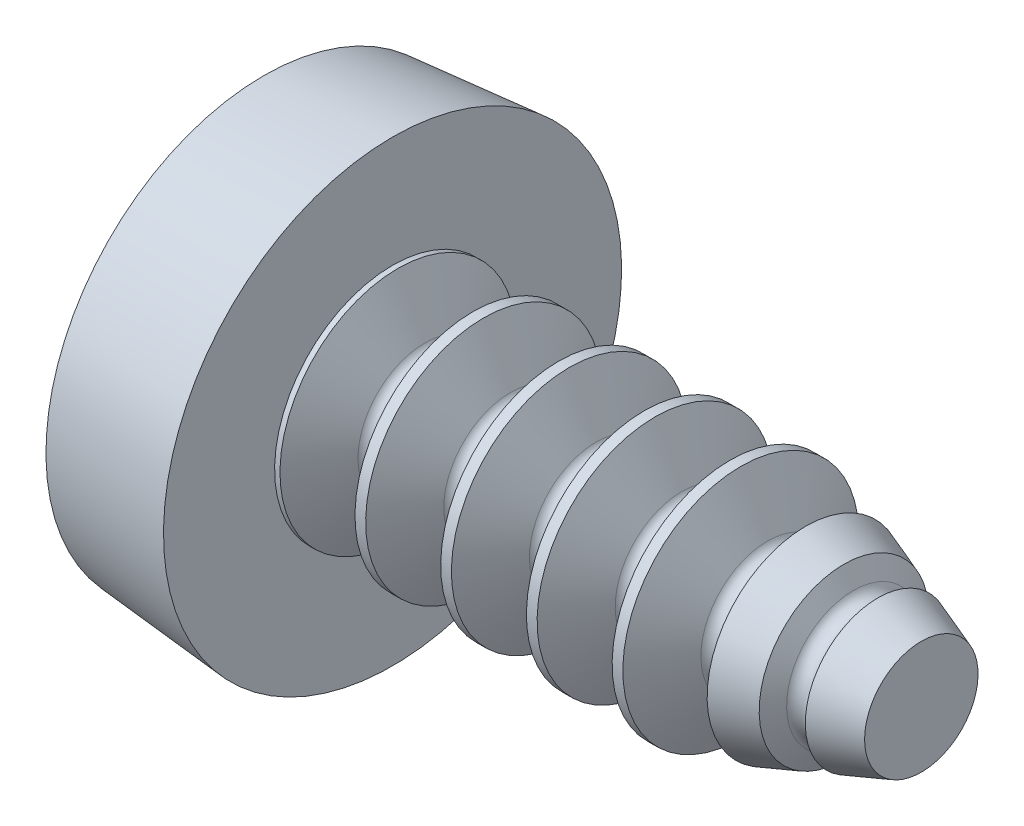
ISO-10303-21;
HEADER;
FILE_DESCRIPTION(('STEP AP214'),'2;1');
FILE_NAME('part.step','',(''),(''),'','','');
FILE_SCHEMA(('AUTOMOTIVE_DESIGN { 1 0 10303 214 1 1 1 1 }'));
ENDSEC;
DATA;
#1=APPLICATION_CONTEXT('core data for automotive mechanical design processes');
#2=APPLICATION_PROTOCOL_DEFINITION('international standard','automotive_design',2000,#1);
#3=PRODUCT_CONTEXT('',#1,'mechanical');
#4=PRODUCT('Part','Part','',(#3));
#5=PRODUCT_RELATED_PRODUCT_CATEGORY('part','',(#4));
#6=PRODUCT_DEFINITION_FORMATION('','',#4);
#7=PRODUCT_DEFINITION_CONTEXT('part definition',#1,'design');
#8=PRODUCT_DEFINITION('design','',#6,#7);
#9=PRODUCT_DEFINITION_SHAPE('','',#8);
#10=(LENGTH_UNIT() NAMED_UNIT(*) SI_UNIT(.MILLI.,.METRE.));
#11=(NAMED_UNIT(*) PLANE_ANGLE_UNIT() SI_UNIT($,.RADIAN.));
#12=(NAMED_UNIT(*) SI_UNIT($,.STERADIAN.) SOLID_ANGLE_UNIT());
#13=UNCERTAINTY_MEASURE_WITH_UNIT(LENGTH_MEASURE(1.E-05),#10,'distance_accuracy_value','');
#14=(GEOMETRIC_REPRESENTATION_CONTEXT(3) GLOBAL_UNCERTAINTY_ASSIGNED_CONTEXT((#13)) GLOBAL_UNIT_ASSIGNED_CONTEXT((#10,
#11,#12)) REPRESENTATION_CONTEXT('',''));
#15=CARTESIAN_POINT('',(0.,0.,0.));
#16=DIRECTION('',(0.,0.,1.));
#17=DIRECTION('',(1.,0.,0.));
#18=AXIS2_PLACEMENT_3D('',#15,#16,#17);
#19=DIRECTION('',(0.940483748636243,-0.339838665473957,0.));
#20=VECTOR('',#19,1.);
#21=CARTESIAN_POINT('',(-499000.,180313.218907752,0.));
#22=LINE('',#21,#20);
#23=CARTESIAN_POINT('',(6.35000000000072,0.,0.));
#24=DIRECTION('',(-1.,0.,0.));
#25=AXIS1_PLACEMENT('',#23,#24);
#26=SURFACE_OF_REVOLUTION('',#22,#25);
#27=CARTESIAN_POINT('',(4.89627290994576,0.,0.));
#28=DIRECTION('',(-1.,0.,0.));
#29=DIRECTION('',(0.,0.,1.));
#30=AXIS2_PLACEMENT_3D('',#27,#28,#29);
#31=CIRCLE('',#30,0.525296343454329);
#32=CARTESIAN_POINT('',(4.89627290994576,0.,0.525296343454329));
#33=VERTEX_POINT('',#32);
#34=EDGE_CURVE('E36',#33,#33,#31,.F.);
#35=ORIENTED_EDGE('',*,*,#34,.F.);
#36=EDGE_LOOP('',(#35));
#37=FACE_BOUND('',#36,.T.);
#38=CARTESIAN_POINT('',(4.49290623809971,0.,0.));
#39=DIRECTION('',(1.,0.,0.));
#40=DIRECTION('',(0.,1.,0.));
#41=AXIS2_PLACEMENT_3D('',#38,#39,#40);
#42=CIRCLE('',#41,0.671050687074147);
#43=CARTESIAN_POINT('',(4.49290623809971,0.671050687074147,0.));
#44=VERTEX_POINT('',#43);
#45=EDGE_CURVE('E11',#44,#44,#42,.T.);
#46=ORIENTED_EDGE('',*,*,#45,.T.);
#47=EDGE_LOOP('',(#46));
#48=FACE_BOUND('',#47,.T.);
#49=ADVANCED_FACE('F32',(#37,#48),#26,.F.);
#50=CARTESIAN_POINT('',(1.66370000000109,0.,0.));
#51=DIRECTION('',(1.,0.,0.));
#52=DIRECTION('',(0.,0.,-1.));
#53=AXIS2_PLACEMENT_3D('',#50,#51,#52);
#54=CYLINDRICAL_SURFACE('',#53,1.09220000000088);
#55=CARTESIAN_POINT('',(3.125390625,0.,0.));
#56=DIRECTION('',(1.,0.,0.));
#57=DIRECTION('',(0.,1.,0.));
#58=AXIS2_PLACEMENT_3D('',#55,#56,#57);
#59=CIRCLE('',#58,1.09220000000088);
#60=CARTESIAN_POINT('',(3.125390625,1.09220000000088,0.));
#61=VERTEX_POINT('',#60);
#62=EDGE_CURVE('E532',#61,#61,#59,.T.);
#63=ORIENTED_EDGE('',*,*,#62,.T.);
#64=EDGE_LOOP('',(#63));
#65=FACE_BOUND('',#64,.T.);
#66=CARTESIAN_POINT('',(3.224609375,0.,0.));
#67=DIRECTION('',(-1.,0.,0.));
#68=DIRECTION('',(0.,1.,0.));
#69=AXIS2_PLACEMENT_3D('',#66,#67,#68);
#70=CIRCLE('',#69,1.09220000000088);
#71=CARTESIAN_POINT('',(3.224609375,1.09220000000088,0.));
#72=VERTEX_POINT('',#71);
#73=EDGE_CURVE('E536',#72,#72,#70,.T.);
#74=ORIENTED_EDGE('',*,*,#73,.T.);
#75=EDGE_LOOP('',(#74));
#76=FACE_BOUND('',#75,.T.);
#77=ADVANCED_FACE('F229',(#65,#76),#54,.T.);
#78=CARTESIAN_POINT('',(0.,1.60655000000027,0.));
#79=DIRECTION('',(1.,0.,0.));
#80=DIRECTION('',(0.,0.,-1.));
#81=AXIS2_PLACEMENT_3D('',#78,#79,#80);
#82=PLANE('',#81);
#83=CARTESIAN_POINT('',(0.,0.,0.));
#84=DIRECTION('',(1.,0.,0.));
#85=DIRECTION('',(0.,1.,0.));
#86=AXIS2_PLACEMENT_3D('',#83,#84,#85);
#87=CIRCLE('',#86,2.12090000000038);
#88=CARTESIAN_POINT('',(0.,2.12090000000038,0.));
#89=VERTEX_POINT('',#88);
#90=EDGE_CURVE('E42',#89,#89,#87,.T.);
#91=ORIENTED_EDGE('',*,*,#90,.T.);
#92=EDGE_LOOP('',(#91));
#93=FACE_BOUND('',#92,.T.);
#94=CARTESIAN_POINT('',(0.,0.,0.));
#95=DIRECTION('',(1.,0.,0.));
#96=DIRECTION('',(0.,1.,0.));
#97=AXIS2_PLACEMENT_3D('',#94,#95,#96);
#98=CIRCLE('',#97,1.09220000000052);
#99=CARTESIAN_POINT('',(0.,1.09220000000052,0.));
#100=VERTEX_POINT('',#99);
#101=EDGE_CURVE('E595',#100,#100,#98,.T.);
#102=ORIENTED_EDGE('',*,*,#101,.F.);
#103=EDGE_LOOP('',(#102));
#104=FACE_BOUND('',#103,.T.);
#105=ADVANCED_FACE('F234',(#93,#104),#82,.T.);
#106=DIRECTION('',(-0.996194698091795,-0.0871557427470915,0.));
#107=VECTOR('',#106,1.);
#108=CARTESIAN_POINT('',(499000.,43658.9639991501,0.));
#109=LINE('',#108,#107);
#110=CARTESIAN_POINT('',(-24.241997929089,0.,0.));
#111=DIRECTION('',(1.,0.,0.));
#112=AXIS1_PLACEMENT('',#110,#111);
#113=SURFACE_OF_REVOLUTION('',#109,#112);
#114=CARTESIAN_POINT('',(-1.19285891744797,0.,0.));
#115=DIRECTION('',(1.,0.,0.));
#116=DIRECTION('',(0.,1.,0.));
#117=AXIS2_PLACEMENT_3D('',#114,#115,#116);
#118=CIRCLE('',#117,2.01653836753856);
#119=CARTESIAN_POINT('',(-1.19285891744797,2.01653836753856,0.));
#120=VERTEX_POINT('',#119);
#121=EDGE_CURVE('E544',#120,#120,#118,.T.);
#122=ORIENTED_EDGE('',*,*,#121,.T.);
#123=EDGE_LOOP('',(#122));
#124=FACE_BOUND('',#123,.T.);
#125=ORIENTED_EDGE('',*,*,#90,.F.);
#126=EDGE_LOOP('',(#125));
#127=FACE_BOUND('',#126,.T.);
#128=ADVANCED_FACE('F238',(#124,#127),#113,.F.);
#129=CARTESIAN_POINT('',(-1.41428414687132,1.32079999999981,-0.3556));
#130=DIRECTION('',(0.,0.,1.));
#131=DIRECTION('',(1.,0.,0.));
#132=AXIS2_PLACEMENT_3D('',#129,#130,#131);
#133=PLANE('',#132);
#134=DIRECTION('',(0.,-1.,0.));
#135=VECTOR('',#134,1.);
#136=CARTESIAN_POINT('',(-0.355600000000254,0.660399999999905,-0.3556));
#137=LINE('',#136,#135);
#138=CARTESIAN_POINT('',(-0.355600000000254,0.355599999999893,-0.355599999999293));
#139=VERTEX_POINT('',#138);
#140=CARTESIAN_POINT('',(-0.355600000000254,-0.355599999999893,-0.3556));
#141=VERTEX_POINT('',#140);
#142=EDGE_CURVE('E473',#139,#141,#137,.T.);
#143=ORIENTED_EDGE('',*,*,#142,.T.);
#144=DIRECTION('',(0.738980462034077,0.673726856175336,0.));
#145=VECTOR('',#144,1.);
#146=CARTESIAN_POINT('',(-1.41428414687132,-1.32079999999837,-0.3556));
#147=LINE('',#146,#145);
#148=CARTESIAN_POINT('',(0.0344415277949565,0.,-0.3556));
#149=VERTEX_POINT('',#148);
#150=EDGE_CURVE('E470',#141,#149,#147,.T.);
#151=ORIENTED_EDGE('',*,*,#150,.T.);
#152=DIRECTION('',(-0.738980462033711,0.673726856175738,0.));
#153=VECTOR('',#152,1.);
#154=CARTESIAN_POINT('',(0.0344415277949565,0.,-0.3556));
#155=LINE('',#154,#153);
#156=EDGE_CURVE('E474',#149,#139,#155,.T.);
#157=ORIENTED_EDGE('',*,*,#156,.T.);
#158=EDGE_LOOP('',(#143,#151,#157));
#159=FACE_BOUND('',#158,.T.);
#160=ADVANCED_FACE('F242',(#159),#133,.T.);
#161=CARTESIAN_POINT('',(-1.41428414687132,1.32079999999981,-0.3556));
#162=DIRECTION('',(0.,0.,1.));
#163=DIRECTION('',(1.,0.,0.));
#164=AXIS2_PLACEMENT_3D('',#161,#162,#163);
#165=PLANE('',#164);
#166=DIRECTION('',(-0.96964659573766,-0.244510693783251,0.));
#167=VECTOR('',#166,1.);
#168=CARTESIAN_POINT('',(-62.1137288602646,-15.8271772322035,-0.355599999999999));
#169=LINE('',#168,#167);
#170=CARTESIAN_POINT('',(-0.758693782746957,-0.355599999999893,-0.355600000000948));
#171=VERTEX_POINT('',#170);
#172=CARTESIAN_POINT('',(-1.53561556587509,-0.55151228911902,-0.3556));
#173=VERTEX_POINT('',#172);
#174=EDGE_CURVE('E480',#171,#173,#169,.T.);
#175=ORIENTED_EDGE('',*,*,#174,.T.);
#176=CARTESIAN_POINT('',(3.93954000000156,3.60955709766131E-13,-0.3556));
#177=DIRECTION('',(0.,0.,-1.));
#178=DIRECTION('',(0.,-1.,0.));
#179=AXIS2_PLACEMENT_3D('',#176,#177,#178);
#180=CIRCLE('',#179,5.50286237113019);
#181=CARTESIAN_POINT('',(-1.40463012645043,-1.31199845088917,-0.3556));
#182=VERTEX_POINT('',#181);
#183=EDGE_CURVE('E185',#182,#173,#180,.T.);
#184=ORIENTED_EDGE('',*,*,#183,.F.);
#185=DIRECTION('',(0.738980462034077,0.673726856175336,0.));
#186=VECTOR('',#185,1.);
#187=CARTESIAN_POINT('',(-1.41428414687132,-1.32079999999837,-0.3556));
#188=LINE('',#187,#186);
#189=EDGE_CURVE('E180',#182,#141,#188,.T.);
#190=ORIENTED_EDGE('',*,*,#189,.T.);
#191=DIRECTION('',(-1.,0.,0.));
#192=VECTOR('',#191,1.);
#193=CARTESIAN_POINT('',(-64.9945420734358,-0.355599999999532,-0.3556));
#194=LINE('',#193,#192);
#195=EDGE_CURVE('E220',#141,#171,#194,.T.);
#196=ORIENTED_EDGE('',*,*,#195,.T.);
#197=EDGE_LOOP('',(#175,#184,#190,#196));
#198=FACE_BOUND('',#197,.T.);
#199=ADVANCED_FACE('F246',(#198),#165,.T.);
#200=CARTESIAN_POINT('',(3.93954000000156,3.60955709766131E-13,0.));
#201=DIRECTION('',(0.706467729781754,0.570320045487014,0.419092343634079));
#202=DIRECTION('',(-0.570351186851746,0.809382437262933,-0.139998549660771));
#203=AXIS2_PLACEMENT_3D('',#200,#201,#202);
#204=SPHERICAL_SURFACE('',#203,5.51434000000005);
#205=ORIENTED_EDGE('',*,*,#121,.F.);
#206=EDGE_LOOP('',(#205));
#207=FACE_BOUND('',#206,.T.);
#208=CARTESIAN_POINT('',(3.76597984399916,-0.68828079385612,-0.491540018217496));
#209=DIRECTION('',(0.201018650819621,0.797171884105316,0.569305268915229));
#210=DIRECTION('',(0.,0.581168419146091,-0.813783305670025));
#211=AXIS2_PLACEMENT_3D('',#208,#209,#210);
#212=CIRCLE('',#211,5.44632724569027);
#213=CARTESIAN_POINT('',(-1.41428414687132,0.933946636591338,-0.933946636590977));
#214=VERTEX_POINT('',#213);
#215=CARTESIAN_POINT('',(-1.53561556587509,0.551512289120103,-0.3556));
#216=VERTEX_POINT('',#215);
#217=EDGE_CURVE('E209',#214,#216,#212,.T.);
#218=ORIENTED_EDGE('',*,*,#217,.T.);
#219=CARTESIAN_POINT('',(3.93954000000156,3.60955709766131E-13,-0.3556));
#220=DIRECTION('',(0.,0.,-1.));
#221=DIRECTION('',(0.,-1.,0.));
#222=AXIS2_PLACEMENT_3D('',#219,#220,#221);
#223=CIRCLE('',#222,5.50286237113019);
#224=CARTESIAN_POINT('',(-1.40463012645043,1.31199845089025,-0.3556));
#225=VERTEX_POINT('',#224);
#226=EDGE_CURVE('E207',#216,#225,#223,.T.);
#227=ORIENTED_EDGE('',*,*,#226,.T.);
#228=CARTESIAN_POINT('',(2.16698504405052,-1.94423521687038,0.));
#229=DIRECTION('',(0.673726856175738,0.738980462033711,0.));
#230=DIRECTION('',(0.,0.,-1.));
#231=AXIS2_PLACEMENT_3D('',#228,#229,#230);
#232=CIRCLE('',#231,4.84622987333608);
#233=CARTESIAN_POINT('',(-1.40463012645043,1.31199845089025,0.3556));
#234=VERTEX_POINT('',#233);
#235=EDGE_CURVE('E210',#225,#234,#232,.T.);
#236=ORIENTED_EDGE('',*,*,#235,.T.);
#237=CARTESIAN_POINT('',(3.93954000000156,3.60955709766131E-13,0.3556));
#238=DIRECTION('',(0.,0.,1.));
#239=DIRECTION('',(0.,1.,0.));
#240=AXIS2_PLACEMENT_3D('',#237,#238,#239);
#241=CIRCLE('',#240,5.50286237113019);
#242=CARTESIAN_POINT('',(-1.53561556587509,0.55151228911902,0.3556));
#243=VERTEX_POINT('',#242);
#244=EDGE_CURVE('E218',#234,#243,#241,.T.);
#245=ORIENTED_EDGE('',*,*,#244,.T.);
#246=CARTESIAN_POINT('',(3.76597984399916,-0.688280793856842,0.491540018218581));
#247=DIRECTION('',(0.201018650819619,0.797171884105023,-0.569305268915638));
#248=DIRECTION('',(0.,-0.581168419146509,-0.813783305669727));
#249=AXIS2_PLACEMENT_3D('',#246,#247,#248);
#250=CIRCLE('',#249,5.44632724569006);
#251=CARTESIAN_POINT('',(-1.41428414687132,0.933946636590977,0.933946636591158));
#252=VERTEX_POINT('',#251);
#253=EDGE_CURVE('E214',#243,#252,#250,.T.);
#254=ORIENTED_EDGE('',*,*,#253,.T.);
#255=CARTESIAN_POINT('',(3.76597984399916,0.491540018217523,-0.688280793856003));
#256=DIRECTION('',(0.201018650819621,-0.569305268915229,0.797171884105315));
#257=DIRECTION('',(0.,0.813783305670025,0.581168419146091));
#258=AXIS2_PLACEMENT_3D('',#255,#256,#257);
#259=CIRCLE('',#258,5.44632724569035);
#260=CARTESIAN_POINT('',(-1.53561556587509,0.355599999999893,0.55151228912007));
#261=VERTEX_POINT('',#260);
#262=EDGE_CURVE('E211',#252,#261,#259,.T.);
#263=ORIENTED_EDGE('',*,*,#262,.T.);
#264=CARTESIAN_POINT('',(3.93954000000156,0.355599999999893,0.));
#265=DIRECTION('',(0.,1.,0.));
#266=DIRECTION('',(0.,0.,-1.));
#267=AXIS2_PLACEMENT_3D('',#264,#265,#266);
#268=CIRCLE('',#267,5.50286237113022);
#269=CARTESIAN_POINT('',(-1.40463012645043,0.355599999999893,1.3119984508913));
#270=VERTEX_POINT('',#269);
#271=EDGE_CURVE('E215',#261,#270,#268,.T.);
#272=ORIENTED_EDGE('',*,*,#271,.T.);
#273=CARTESIAN_POINT('',(2.16698504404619,3.60955709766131E-13,-1.94423521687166));
#274=DIRECTION('',(0.673726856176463,0.,0.73898046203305));
#275=DIRECTION('',(0.,1.,0.));
#276=AXIS2_PLACEMENT_3D('',#273,#274,#275);
#277=CIRCLE('',#276,4.84622987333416);
#278=CARTESIAN_POINT('',(-1.40463012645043,-0.355599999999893,1.31199845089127));
#279=VERTEX_POINT('',#278);
#280=EDGE_CURVE('E492',#270,#279,#277,.T.);
#281=ORIENTED_EDGE('',*,*,#280,.T.);
#282=CARTESIAN_POINT('',(3.93954000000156,-0.355599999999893,0.));
#283=DIRECTION('',(0.,-1.,0.));
#284=DIRECTION('',(0.,0.,1.));
#285=AXIS2_PLACEMENT_3D('',#282,#283,#284);
#286=CIRCLE('',#285,5.50286237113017);
#287=CARTESIAN_POINT('',(-1.53561556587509,-0.355599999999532,0.551512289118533));
#288=VERTEX_POINT('',#287);
#289=EDGE_CURVE('E479',#279,#288,#286,.T.);
#290=ORIENTED_EDGE('',*,*,#289,.T.);
#291=CARTESIAN_POINT('',(3.76597984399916,-0.491540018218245,-0.68828079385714));
#292=DIRECTION('',(0.201018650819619,0.569305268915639,0.797171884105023));
#293=DIRECTION('',(0.,0.813783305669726,-0.581168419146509));
#294=AXIS2_PLACEMENT_3D('',#291,#292,#293);
#295=CIRCLE('',#294,5.44632724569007);
#296=CARTESIAN_POINT('',(-1.41428414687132,-0.933946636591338,0.933946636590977));
#297=VERTEX_POINT('',#296);
#298=EDGE_CURVE('E477',#288,#297,#295,.T.);
#299=ORIENTED_EDGE('',*,*,#298,.T.);
#300=CARTESIAN_POINT('',(3.76597984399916,0.68828079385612,0.491540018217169));
#301=DIRECTION('',(0.201018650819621,-0.797171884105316,-0.569305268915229));
#302=DIRECTION('',(0.,-0.581168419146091,0.813783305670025));
#303=AXIS2_PLACEMENT_3D('',#300,#301,#302);
#304=CIRCLE('',#303,5.44632724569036);
#305=CARTESIAN_POINT('',(-1.53561556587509,-0.551512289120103,0.3556));
#306=VERTEX_POINT('',#305);
#307=EDGE_CURVE('E193',#297,#306,#304,.T.);
#308=ORIENTED_EDGE('',*,*,#307,.T.);
#309=CARTESIAN_POINT('',(3.93954000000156,3.60955709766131E-13,0.3556));
#310=DIRECTION('',(0.,0.,1.));
#311=DIRECTION('',(0.,1.,0.));
#312=AXIS2_PLACEMENT_3D('',#309,#310,#311);
#313=CIRCLE('',#312,5.50286237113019);
#314=CARTESIAN_POINT('',(-1.40463012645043,-1.31199845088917,0.3556));
#315=VERTEX_POINT('',#314);
#316=EDGE_CURVE('E184',#306,#315,#313,.T.);
#317=ORIENTED_EDGE('',*,*,#316,.T.);
#318=CARTESIAN_POINT('',(2.16698504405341,1.94423521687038,0.));
#319=DIRECTION('',(0.673726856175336,-0.738980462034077,0.));
#320=DIRECTION('',(0.,0.,1.));
#321=AXIS2_PLACEMENT_3D('',#318,#319,#320);
#322=CIRCLE('',#321,4.84622987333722);
#323=EDGE_CURVE('E173',#315,#182,#322,.T.);
#324=ORIENTED_EDGE('',*,*,#323,.T.);
#325=ORIENTED_EDGE('',*,*,#183,.T.);
#326=CARTESIAN_POINT('',(3.76597984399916,0.688280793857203,-0.491540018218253));
#327=DIRECTION('',(0.201018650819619,-0.797171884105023,0.569305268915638));
#328=DIRECTION('',(0.,0.58116841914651,0.813783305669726));
#329=AXIS2_PLACEMENT_3D('',#326,#327,#328);
#330=CIRCLE('',#329,5.44632724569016);
#331=CARTESIAN_POINT('',(-1.41428414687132,-0.933946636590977,-0.933946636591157));
#332=VERTEX_POINT('',#331);
#333=EDGE_CURVE('E428',#173,#332,#330,.T.);
#334=ORIENTED_EDGE('',*,*,#333,.T.);
#335=CARTESIAN_POINT('',(3.76597984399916,-0.491540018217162,0.688280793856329));
#336=DIRECTION('',(0.201018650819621,0.569305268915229,-0.797171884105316));
#337=DIRECTION('',(0.,-0.813783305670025,-0.581168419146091));
#338=AXIS2_PLACEMENT_3D('',#335,#336,#337);
#339=CIRCLE('',#338,5.44632724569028);
#340=CARTESIAN_POINT('',(-1.53561556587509,-0.355599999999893,-0.55151228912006));
#341=VERTEX_POINT('',#340);
#342=EDGE_CURVE('E421',#332,#341,#339,.T.);
#343=ORIENTED_EDGE('',*,*,#342,.T.);
#344=CARTESIAN_POINT('',(3.93954000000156,-0.355599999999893,0.));
#345=DIRECTION('',(0.,-1.,0.));
#346=DIRECTION('',(0.,0.,1.));
#347=AXIS2_PLACEMENT_3D('',#344,#345,#346);
#348=CIRCLE('',#347,5.50286237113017);
#349=CARTESIAN_POINT('',(-1.40463012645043,-0.355599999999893,-1.31199845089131));
#350=VERTEX_POINT('',#349);
#351=EDGE_CURVE('E429',#341,#350,#348,.T.);
#352=ORIENTED_EDGE('',*,*,#351,.T.);
#353=CARTESIAN_POINT('',(2.16698504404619,3.60955709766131E-13,1.94423521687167));
#354=DIRECTION('',(0.673726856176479,0.,-0.738980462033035));
#355=DIRECTION('',(0.,-1.,0.));
#356=AXIS2_PLACEMENT_3D('',#353,#354,#355);
#357=CIRCLE('',#356,4.84622987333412);
#358=CARTESIAN_POINT('',(-1.40463012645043,0.355599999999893,-1.31199845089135));
#359=VERTEX_POINT('',#358);
#360=EDGE_CURVE('E432',#350,#359,#357,.T.);
#361=ORIENTED_EDGE('',*,*,#360,.T.);
#362=CARTESIAN_POINT('',(3.93954000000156,0.355599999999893,0.));
#363=DIRECTION('',(0.,1.,0.));
#364=DIRECTION('',(0.,0.,-1.));
#365=AXIS2_PLACEMENT_3D('',#362,#363,#364);
#366=CIRCLE('',#365,5.50286237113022);
#367=CARTESIAN_POINT('',(-1.53561556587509,0.355599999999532,-0.551512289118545));
#368=VERTEX_POINT('',#367);
#369=EDGE_CURVE('E499',#359,#368,#366,.T.);
#370=ORIENTED_EDGE('',*,*,#369,.T.);
#371=CARTESIAN_POINT('',(3.76597984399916,0.491540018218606,0.688280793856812));
#372=DIRECTION('',(0.201018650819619,-0.569305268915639,-0.797171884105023));
#373=DIRECTION('',(0.,-0.813783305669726,0.58116841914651));
#374=AXIS2_PLACEMENT_3D('',#371,#372,#373);
#375=CIRCLE('',#374,5.44632724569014);
#376=EDGE_CURVE('E502',#368,#214,#375,.T.);
#377=ORIENTED_EDGE('',*,*,#376,.T.);
#378=EDGE_LOOP('',(#218,#227,#236,#245,#254,#263,#272,#281,#290,#299,#308,#317,#324,#325,#334,
#343,#352,#361,#370,#377));
#379=FACE_BOUND('',#378,.T.);
#380=ADVANCED_FACE('F190',(#207,#379),#204,.T.);
#381=CARTESIAN_POINT('',(0.0344415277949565,0.,0.));
#382=DIRECTION('',(-0.673726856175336,0.738980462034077,0.));
#383=DIRECTION('',(-0.738980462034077,-0.673726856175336,0.));
#384=AXIS2_PLACEMENT_3D('',#381,#382,#383);
#385=PLANE('',#384);
#386=DIRECTION('',(0.,0.,-1.));
#387=VECTOR('',#386,1.);
#388=CARTESIAN_POINT('',(-0.355600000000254,-0.355600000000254,0.660399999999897));
#389=LINE('',#388,#387);
#390=CARTESIAN_POINT('',(-0.355600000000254,-0.355599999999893,0.3556));
#391=VERTEX_POINT('',#390);
#392=EDGE_CURVE('E560',#391,#141,#389,.T.);
#393=ORIENTED_EDGE('',*,*,#392,.T.);
#394=ORIENTED_EDGE('',*,*,#189,.F.);
#395=ORIENTED_EDGE('',*,*,#323,.F.);
#396=DIRECTION('',(-0.738980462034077,-0.673726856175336,0.));
#397=VECTOR('',#396,1.);
#398=CARTESIAN_POINT('',(-1.41428414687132,-1.32079999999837,0.3556));
#399=LINE('',#398,#397);
#400=EDGE_CURVE('E178',#391,#315,#399,.T.);
#401=ORIENTED_EDGE('',*,*,#400,.F.);
#402=EDGE_LOOP('',(#393,#394,#395,#401));
#403=FACE_BOUND('',#402,.T.);
#404=ADVANCED_FACE('F176',(#403),#385,.T.);
#405=CARTESIAN_POINT('',(0.0344415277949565,0.,0.));
#406=DIRECTION('',(-0.673726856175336,0.738980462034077,0.));
#407=DIRECTION('',(-0.738980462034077,-0.673726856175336,0.));
#408=AXIS2_PLACEMENT_3D('',#405,#406,#407);
#409=PLANE('',#408);
#410=DIRECTION('',(-0.612864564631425,-0.558747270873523,0.558747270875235));
#411=VECTOR('',#410,1.);
#412=CARTESIAN_POINT('',(-0.463776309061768,-0.45422410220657,0.454224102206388));
#413=LINE('',#412,#411);
#414=CARTESIAN_POINT('',(0.0344415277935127,1.44382283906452E-12,0.));
#415=VERTEX_POINT('',#414);
#416=EDGE_CURVE('E548',#415,#391,#413,.T.);
#417=ORIENTED_EDGE('',*,*,#416,.T.);
#418=DIRECTION('',(-0.738980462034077,-0.673726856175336,0.));
#419=VECTOR('',#418,1.);
#420=CARTESIAN_POINT('',(-1.41428414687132,-1.32079999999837,0.3556));
#421=LINE('',#420,#419);
#422=CARTESIAN_POINT('',(0.0344415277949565,0.,0.3556));
#423=VERTEX_POINT('',#422);
#424=EDGE_CURVE('E437',#423,#391,#421,.T.);
#425=ORIENTED_EDGE('',*,*,#424,.F.);
#426=DIRECTION('',(0.,0.,-1.));
#427=VECTOR('',#426,1.);
#428=CARTESIAN_POINT('',(0.0344415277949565,0.,0.));
#429=LINE('',#428,#427);
#430=EDGE_CURVE('E545',#423,#415,#429,.T.);
#431=ORIENTED_EDGE('',*,*,#430,.T.);
#432=EDGE_LOOP('',(#417,#425,#431));
#433=FACE_BOUND('',#432,.T.);
#434=ADVANCED_FACE('F956',(#433),#409,.T.);
#435=CARTESIAN_POINT('',(0.0344415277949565,0.,0.));
#436=DIRECTION('',(-0.673726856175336,0.738980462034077,0.));
#437=DIRECTION('',(-0.738980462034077,-0.673726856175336,0.));
#438=AXIS2_PLACEMENT_3D('',#435,#436,#437);
#439=PLANE('',#438);
#440=DIRECTION('',(0.612864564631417,0.558747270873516,0.558747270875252));
#441=VECTOR('',#440,1.);
#442=CARTESIAN_POINT('',(0.0344415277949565,0.,3.59418748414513E-13));
#443=LINE('',#442,#441);
#444=EDGE_CURVE('E515',#141,#415,#443,.T.);
#445=ORIENTED_EDGE('',*,*,#444,.T.);
#446=DIRECTION('',(0.,0.,-1.));
#447=VECTOR('',#446,1.);
#448=CARTESIAN_POINT('',(0.0344415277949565,0.,0.));
#449=LINE('',#448,#447);
#450=EDGE_CURVE('E519',#415,#149,#449,.T.);
#451=ORIENTED_EDGE('',*,*,#450,.T.);
#452=ORIENTED_EDGE('',*,*,#150,.F.);
#453=EDGE_LOOP('',(#445,#451,#452));
#454=FACE_BOUND('',#453,.T.);
#455=ADVANCED_FACE('F946',(#454),#439,.T.);
#456=CARTESIAN_POINT('',(-1.41428414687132,1.32079999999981,0.));
#457=DIRECTION('',(-0.673726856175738,-0.738980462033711,0.));
#458=DIRECTION('',(0.738980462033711,-0.673726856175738,0.));
#459=AXIS2_PLACEMENT_3D('',#456,#457,#458);
#460=PLANE('',#459);
#461=DIRECTION('',(0.612864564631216,-0.558747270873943,-0.558747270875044));
#462=VECTOR('',#461,1.);
#463=CARTESIAN_POINT('',(-0.961994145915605,0.908448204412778,0.908448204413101));
#464=LINE('',#463,#462);
#465=CARTESIAN_POINT('',(-0.355600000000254,0.355599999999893,0.355599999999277));
#466=VERTEX_POINT('',#465);
#467=EDGE_CURVE('E497',#466,#415,#464,.T.);
#468=ORIENTED_EDGE('',*,*,#467,.T.);
#469=ORIENTED_EDGE('',*,*,#430,.F.);
#470=DIRECTION('',(0.738980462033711,-0.673726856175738,0.));
#471=VECTOR('',#470,1.);
#472=CARTESIAN_POINT('',(0.0344415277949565,0.,0.3556));
#473=LINE('',#472,#471);
#474=EDGE_CURVE('E440',#466,#423,#473,.T.);
#475=ORIENTED_EDGE('',*,*,#474,.F.);
#476=EDGE_LOOP('',(#468,#469,#475));
#477=FACE_BOUND('',#476,.T.);
#478=ADVANCED_FACE('F937',(#477),#460,.T.);
#479=CARTESIAN_POINT('',(-1.41428414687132,1.32079999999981,0.));
#480=DIRECTION('',(-0.673726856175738,-0.738980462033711,0.));
#481=DIRECTION('',(0.738980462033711,-0.673726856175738,0.));
#482=AXIS2_PLACEMENT_3D('',#479,#480,#481);
#483=PLANE('',#482);
#484=DIRECTION('',(0.,0.,1.));
#485=VECTOR('',#484,1.);
#486=CARTESIAN_POINT('',(-0.35559999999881,0.355599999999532,-0.660399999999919));
#487=LINE('',#486,#485);
#488=EDGE_CURVE('E495',#139,#466,#487,.T.);
#489=ORIENTED_EDGE('',*,*,#488,.T.);
#490=DIRECTION('',(0.738980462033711,-0.673726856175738,0.));
#491=VECTOR('',#490,1.);
#492=CARTESIAN_POINT('',(0.0344415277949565,0.,0.3556));
#493=LINE('',#492,#491);
#494=EDGE_CURVE('E101',#234,#466,#493,.T.);
#495=ORIENTED_EDGE('',*,*,#494,.F.);
#496=ORIENTED_EDGE('',*,*,#235,.F.);
#497=DIRECTION('',(-0.738980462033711,0.673726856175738,0.));
#498=VECTOR('',#497,1.);
#499=CARTESIAN_POINT('',(0.0344415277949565,0.,-0.3556));
#500=LINE('',#499,#498);
#501=EDGE_CURVE('E90',#139,#225,#500,.T.);
#502=ORIENTED_EDGE('',*,*,#501,.F.);
#503=EDGE_LOOP('',(#489,#495,#496,#502));
#504=FACE_BOUND('',#503,.T.);
#505=ADVANCED_FACE('F927',(#504),#483,.T.);
#506=CARTESIAN_POINT('',(-1.41428414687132,1.32079999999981,0.));
#507=DIRECTION('',(-0.673726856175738,-0.738980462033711,0.));
#508=DIRECTION('',(0.738980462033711,-0.673726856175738,0.));
#509=AXIS2_PLACEMENT_3D('',#506,#507,#508);
#510=PLANE('',#509);
#511=DIRECTION('',(-0.612864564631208,0.558747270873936,-0.558747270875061));
#512=VECTOR('',#511,1.);
#513=CARTESIAN_POINT('',(-0.463776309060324,0.454224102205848,-0.454224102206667));
#514=LINE('',#513,#512);
#515=EDGE_CURVE('E498',#415,#139,#514,.T.);
#516=ORIENTED_EDGE('',*,*,#515,.T.);
#517=ORIENTED_EDGE('',*,*,#156,.F.);
#518=ORIENTED_EDGE('',*,*,#450,.F.);
#519=EDGE_LOOP('',(#516,#517,#518));
#520=FACE_BOUND('',#519,.T.);
#521=ADVANCED_FACE('F917',(#520),#510,.T.);
#522=CARTESIAN_POINT('',(0.0344415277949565,0.,0.3556));
#523=DIRECTION('',(0.,0.,-1.));
#524=DIRECTION('',(-1.,0.,0.));
#525=AXIS2_PLACEMENT_3D('',#522,#523,#524);
#526=PLANE('',#525);
#527=DIRECTION('',(0.,1.,0.));
#528=VECTOR('',#527,1.);
#529=CARTESIAN_POINT('',(-0.355600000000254,0.,0.3556));
#530=LINE('',#529,#528);
#531=EDGE_CURVE('E509',#391,#466,#530,.T.);
#532=ORIENTED_EDGE('',*,*,#531,.T.);
#533=ORIENTED_EDGE('',*,*,#474,.T.);
#534=ORIENTED_EDGE('',*,*,#424,.T.);
#535=EDGE_LOOP('',(#532,#533,#534));
#536=FACE_BOUND('',#535,.T.);
#537=ADVANCED_FACE('F907',(#536),#526,.T.);
#538=CARTESIAN_POINT('',(0.0344415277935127,0.,0.));
#539=DIRECTION('',(-0.673726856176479,0.,0.738980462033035));
#540=DIRECTION('',(0.738980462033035,0.,0.673726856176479));
#541=AXIS2_PLACEMENT_3D('',#538,#539,#540);
#542=PLANE('',#541);
#543=ORIENTED_EDGE('',*,*,#142,.F.);
#544=DIRECTION('',(0.738980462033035,0.,0.673726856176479));
#545=VECTOR('',#544,1.);
#546=CARTESIAN_POINT('',(0.0344415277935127,0.355599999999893,0.));
#547=LINE('',#546,#545);
#548=EDGE_CURVE('E573',#359,#139,#547,.T.);
#549=ORIENTED_EDGE('',*,*,#548,.F.);
#550=ORIENTED_EDGE('',*,*,#360,.F.);
#551=DIRECTION('',(-0.738980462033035,0.,-0.673726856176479));
#552=VECTOR('',#551,1.);
#553=CARTESIAN_POINT('',(0.0344415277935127,-0.355599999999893,0.));
#554=LINE('',#553,#552);
#555=EDGE_CURVE('E442',#141,#350,#554,.T.);
#556=ORIENTED_EDGE('',*,*,#555,.F.);
#557=EDGE_LOOP('',(#543,#549,#550,#556));
#558=FACE_BOUND('',#557,.T.);
#559=ADVANCED_FACE('F897',(#558),#542,.T.);
#560=CARTESIAN_POINT('',(0.0344415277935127,0.,0.));
#561=DIRECTION('',(-0.673726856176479,0.,0.738980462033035));
#562=DIRECTION('',(0.738980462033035,0.,0.673726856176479));
#563=AXIS2_PLACEMENT_3D('',#560,#561,#562);
#564=PLANE('',#563);
#565=ORIENTED_EDGE('',*,*,#515,.F.);
#566=DIRECTION('',(0.,1.,0.));
#567=VECTOR('',#566,1.);
#568=CARTESIAN_POINT('',(0.0344415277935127,0.,0.));
#569=LINE('',#568,#567);
#570=CARTESIAN_POINT('',(0.0344415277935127,0.355599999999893,0.));
#571=VERTEX_POINT('',#570);
#572=EDGE_CURVE('E441',#415,#571,#569,.T.);
#573=ORIENTED_EDGE('',*,*,#572,.T.);
#574=DIRECTION('',(0.738980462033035,0.,0.673726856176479));
#575=VECTOR('',#574,1.);
#576=CARTESIAN_POINT('',(0.0344415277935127,0.355599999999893,0.));
#577=LINE('',#576,#575);
#578=EDGE_CURVE('E510',#139,#571,#577,.T.);
#579=ORIENTED_EDGE('',*,*,#578,.F.);
#580=EDGE_LOOP('',(#565,#573,#579));
#581=FACE_BOUND('',#580,.T.);
#582=ADVANCED_FACE('F888',(#581),#564,.T.);
#583=CARTESIAN_POINT('',(0.0344415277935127,0.,0.));
#584=DIRECTION('',(-0.673726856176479,0.,0.738980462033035));
#585=DIRECTION('',(0.738980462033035,0.,0.673726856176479));
#586=AXIS2_PLACEMENT_3D('',#583,#584,#585);
#587=PLANE('',#586);
#588=ORIENTED_EDGE('',*,*,#444,.F.);
#589=DIRECTION('',(-0.738980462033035,0.,-0.673726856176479));
#590=VECTOR('',#589,1.);
#591=CARTESIAN_POINT('',(0.0344415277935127,-0.355599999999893,0.));
#592=LINE('',#591,#590);
#593=CARTESIAN_POINT('',(0.0344415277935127,-0.355599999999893,0.));
#594=VERTEX_POINT('',#593);
#595=EDGE_CURVE('E51',#594,#141,#592,.T.);
#596=ORIENTED_EDGE('',*,*,#595,.F.);
#597=DIRECTION('',(0.,1.,0.));
#598=VECTOR('',#597,1.);
#599=CARTESIAN_POINT('',(0.0344415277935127,0.,0.));
#600=LINE('',#599,#598);
#601=EDGE_CURVE('E148',#594,#415,#600,.T.);
#602=ORIENTED_EDGE('',*,*,#601,.T.);
#603=EDGE_LOOP('',(#588,#596,#602));
#604=FACE_BOUND('',#603,.T.);
#605=ADVANCED_FACE('F879',(#604),#587,.T.);
#606=CARTESIAN_POINT('',(-128.5748,-0.355599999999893,1.32079999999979));
#607=DIRECTION('',(0.,1.,0.));
#608=DIRECTION('',(0.,0.,1.));
#609=AXIS2_PLACEMENT_3D('',#606,#607,#608);
#610=PLANE('',#609);
#611=DIRECTION('',(-0.96964659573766,0.,0.244510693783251));
#612=VECTOR('',#611,1.);
#613=CARTESIAN_POINT('',(-122.205957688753,-0.355599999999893,30.9803192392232));
#614=LINE('',#613,#612);
#615=CARTESIAN_POINT('',(-0.758693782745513,-0.355599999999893,0.355599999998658));
#616=VERTEX_POINT('',#615);
#617=EDGE_CURVE('E551',#616,#288,#614,.T.);
#618=ORIENTED_EDGE('',*,*,#617,.T.);
#619=ORIENTED_EDGE('',*,*,#289,.F.);
#620=DIRECTION('',(0.73898046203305,0.,-0.673726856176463));
#621=VECTOR('',#620,1.);
#622=CARTESIAN_POINT('',(-1.41428414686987,-0.355599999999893,1.32079999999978));
#623=LINE('',#622,#621);
#624=EDGE_CURVE('E549',#279,#391,#623,.T.);
#625=ORIENTED_EDGE('',*,*,#624,.T.);
#626=DIRECTION('',(1.,0.,0.));
#627=VECTOR('',#626,1.);
#628=CARTESIAN_POINT('',(-64.2701792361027,-0.355600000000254,0.3556));
#629=LINE('',#628,#627);
#630=EDGE_CURVE('E120',#616,#391,#629,.T.);
#631=ORIENTED_EDGE('',*,*,#630,.F.);
#632=EDGE_LOOP('',(#618,#619,#625,#631));
#633=FACE_BOUND('',#632,.T.);
#634=ADVANCED_FACE('F869',(#633),#610,.T.);
#635=CARTESIAN_POINT('',(-128.5748,-0.355599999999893,1.32079999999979));
#636=DIRECTION('',(0.,1.,0.));
#637=DIRECTION('',(0.,0.,1.));
#638=AXIS2_PLACEMENT_3D('',#635,#636,#637);
#639=PLANE('',#638);
#640=DIRECTION('',(0.969646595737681,0.,0.244510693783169));
#641=VECTOR('',#640,1.);
#642=CARTESIAN_POINT('',(-91.2808940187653,-0.355599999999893,-23.1821082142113));
#643=LINE('',#642,#641);
#644=EDGE_CURVE('E424',#341,#171,#643,.T.);
#645=ORIENTED_EDGE('',*,*,#644,.T.);
#646=ORIENTED_EDGE('',*,*,#195,.F.);
#647=ORIENTED_EDGE('',*,*,#555,.T.);
#648=ORIENTED_EDGE('',*,*,#351,.F.);
#649=EDGE_LOOP('',(#645,#646,#647,#648));
#650=FACE_BOUND('',#649,.T.);
#651=ADVANCED_FACE('F860',(#650),#639,.T.);
#652=CARTESIAN_POINT('',(-128.5748,-0.355599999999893,1.32079999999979));
#653=DIRECTION('',(0.,1.,0.));
#654=DIRECTION('',(0.,0.,1.));
#655=AXIS2_PLACEMENT_3D('',#652,#653,#654);
#656=PLANE('',#655);
#657=ORIENTED_EDGE('',*,*,#392,.F.);
#658=DIRECTION('',(0.73898046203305,0.,-0.673726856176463));
#659=VECTOR('',#658,1.);
#660=CARTESIAN_POINT('',(-1.41428414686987,-0.355599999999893,1.32079999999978));
#661=LINE('',#660,#659);
#662=EDGE_CURVE('E444',#391,#594,#661,.T.);
#663=ORIENTED_EDGE('',*,*,#662,.T.);
#664=ORIENTED_EDGE('',*,*,#595,.T.);
#665=EDGE_LOOP('',(#657,#663,#664));
#666=FACE_BOUND('',#665,.T.);
#667=ADVANCED_FACE('F850',(#666),#656,.T.);
#668=CARTESIAN_POINT('',(-1.41428414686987,0.,1.32079999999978));
#669=DIRECTION('',(-0.673726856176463,0.,-0.73898046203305));
#670=DIRECTION('',(-0.73898046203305,0.,0.673726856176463));
#671=AXIS2_PLACEMENT_3D('',#668,#669,#670);
#672=PLANE('',#671);
#673=ORIENTED_EDGE('',*,*,#416,.F.);
#674=ORIENTED_EDGE('',*,*,#601,.F.);
#675=ORIENTED_EDGE('',*,*,#662,.F.);
#676=EDGE_LOOP('',(#673,#674,#675));
#677=FACE_BOUND('',#676,.T.);
#678=ADVANCED_FACE('F840',(#677),#672,.T.);
#679=CARTESIAN_POINT('',(-1.41428414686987,0.,1.32079999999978));
#680=DIRECTION('',(-0.673726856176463,0.,-0.73898046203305));
#681=DIRECTION('',(-0.73898046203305,0.,0.673726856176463));
#682=AXIS2_PLACEMENT_3D('',#679,#680,#681);
#683=PLANE('',#682);
#684=ORIENTED_EDGE('',*,*,#467,.F.);
#685=DIRECTION('',(-0.73898046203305,0.,0.673726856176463));
#686=VECTOR('',#685,1.);
#687=CARTESIAN_POINT('',(-1.41428414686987,0.355599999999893,1.32079999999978));
#688=LINE('',#687,#686);
#689=EDGE_CURVE('E205',#571,#466,#688,.T.);
#690=ORIENTED_EDGE('',*,*,#689,.F.);
#691=ORIENTED_EDGE('',*,*,#572,.F.);
#692=EDGE_LOOP('',(#684,#690,#691));
#693=FACE_BOUND('',#692,.T.);
#694=ADVANCED_FACE('F831',(#693),#683,.T.);
#695=CARTESIAN_POINT('',(-1.41428414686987,0.,1.32079999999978));
#696=DIRECTION('',(-0.673726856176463,0.,-0.73898046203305));
#697=DIRECTION('',(-0.73898046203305,0.,0.673726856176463));
#698=AXIS2_PLACEMENT_3D('',#695,#696,#697);
#699=PLANE('',#698);
#700=ORIENTED_EDGE('',*,*,#280,.F.);
#701=DIRECTION('',(-0.73898046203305,0.,0.673726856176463));
#702=VECTOR('',#701,1.);
#703=CARTESIAN_POINT('',(-1.41428414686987,0.355599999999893,1.32079999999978));
#704=LINE('',#703,#702);
#705=EDGE_CURVE('E141',#466,#270,#704,.T.);
#706=ORIENTED_EDGE('',*,*,#705,.F.);
#707=ORIENTED_EDGE('',*,*,#531,.F.);
#708=ORIENTED_EDGE('',*,*,#624,.F.);
#709=EDGE_LOOP('',(#700,#706,#707,#708));
#710=FACE_BOUND('',#709,.T.);
#711=ADVANCED_FACE('F821',(#710),#699,.T.);
#712=CARTESIAN_POINT('',(-128.5748,0.355599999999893,-1.32079999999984));
#713=DIRECTION('',(0.,-1.,0.));
#714=DIRECTION('',(0.,0.,-1.));
#715=AXIS2_PLACEMENT_3D('',#712,#713,#714);
#716=PLANE('',#715);
#717=ORIENTED_EDGE('',*,*,#488,.F.);
#718=ORIENTED_EDGE('',*,*,#578,.T.);
#719=ORIENTED_EDGE('',*,*,#689,.T.);
#720=EDGE_LOOP('',(#717,#718,#719));
#721=FACE_BOUND('',#720,.T.);
#722=ADVANCED_FACE('F813',(#721),#716,.T.);
#723=CARTESIAN_POINT('',(-128.5748,0.355599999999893,-1.32079999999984));
#724=DIRECTION('',(0.,-1.,0.));
#725=DIRECTION('',(0.,0.,-1.));
#726=AXIS2_PLACEMENT_3D('',#723,#724,#725);
#727=PLANE('',#726);
#728=DIRECTION('',(-0.96964659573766,0.,-0.244510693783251));
#729=VECTOR('',#728,1.);
#730=CARTESIAN_POINT('',(-122.205957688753,0.355599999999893,-30.9803192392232));
#731=LINE('',#730,#729);
#732=CARTESIAN_POINT('',(-0.758693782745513,0.355599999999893,-0.355599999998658));
#733=VERTEX_POINT('',#732);
#734=EDGE_CURVE('E574',#733,#368,#731,.T.);
#735=ORIENTED_EDGE('',*,*,#734,.T.);
#736=ORIENTED_EDGE('',*,*,#369,.F.);
#737=ORIENTED_EDGE('',*,*,#548,.T.);
#738=DIRECTION('',(1.,0.,0.));
#739=VECTOR('',#738,1.);
#740=CARTESIAN_POINT('',(-64.9945420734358,0.355599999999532,-0.3556));
#741=LINE('',#740,#739);
#742=EDGE_CURVE('E129',#733,#139,#741,.T.);
#743=ORIENTED_EDGE('',*,*,#742,.F.);
#744=EDGE_LOOP('',(#735,#736,#737,#743));
#745=FACE_BOUND('',#744,.T.);
#746=ADVANCED_FACE('F804',(#745),#727,.T.);
#747=CARTESIAN_POINT('',(1.66370000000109,0.,0.));
#748=DIRECTION('',(1.,0.,0.));
#749=DIRECTION('',(0.,0.,-1.));
#750=AXIS2_PLACEMENT_3D('',#747,#748,#749);
#751=CYLINDRICAL_SURFACE('',#750,1.09220000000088);
#752=ORIENTED_EDGE('',*,*,#101,.T.);
#753=EDGE_LOOP('',(#752));
#754=FACE_BOUND('',#753,.T.);
#755=CARTESIAN_POINT('',(0.049609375,0.,0.));
#756=DIRECTION('',(-1.,0.,0.));
#757=DIRECTION('',(0.,1.,0.));
#758=AXIS2_PLACEMENT_3D('',#755,#756,#757);
#759=CIRCLE('',#758,1.09220000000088);
#760=CARTESIAN_POINT('',(0.049609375,1.09220000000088,0.));
#761=VERTEX_POINT('',#760);
#762=EDGE_CURVE('E535',#761,#761,#759,.T.);
#763=ORIENTED_EDGE('',*,*,#762,.T.);
#764=EDGE_LOOP('',(#763));
#765=FACE_BOUND('',#764,.T.);
#766=ADVANCED_FACE('F267',(#754,#765),#751,.T.);
#767=DIRECTION('',(0.462986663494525,-0.886365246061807,0.));
#768=VECTOR('',#767,1.);
#769=CARTESIAN_POINT('',(-260648.526625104,499000.,0.));
#770=LINE('',#769,#768);
#771=CARTESIAN_POINT('',(0.62011237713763,0.,0.));
#772=DIRECTION('',(-1.,0.,0.));
#773=AXIS1_PLACEMENT('',#771,#772);
#774=SURFACE_OF_REVOLUTION('',#770,#773);
#775=CARTESIAN_POINT('',(0.29765625,0.,0.));
#776=DIRECTION('',(1.,0.,0.));
#777=DIRECTION('',(0.,1.,0.));
#778=AXIS2_PLACEMENT_3D('',#775,#776,#777);
#779=CIRCLE('',#778,0.61732643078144);
#780=CARTESIAN_POINT('',(0.29765625,0.61732643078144,0.));
#781=VERTEX_POINT('',#780);
#782=EDGE_CURVE('E523',#781,#781,#779,.T.);
#783=ORIENTED_EDGE('',*,*,#782,.F.);
#784=EDGE_LOOP('',(#783));
#785=FACE_BOUND('',#784,.T.);
#786=ORIENTED_EDGE('',*,*,#762,.F.);
#787=EDGE_LOOP('',(#786));
#788=FACE_BOUND('',#787,.T.);
#789=ADVANCED_FACE('F262',(#785,#788),#774,.F.);
#790=CARTESIAN_POINT('',(0.396875,0.,0.));
#791=DIRECTION('',(1.,0.,0.));
#792=DIRECTION('',(0.,0.,-1.));
#793=AXIS2_PLACEMENT_3D('',#790,#791,#792);
#794=TOROIDAL_SURFACE('',#793,0.66915264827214,0.111938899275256);
#795=CARTESIAN_POINT('',(0.49609375,0.,0.));
#796=DIRECTION('',(1.,0.,0.));
#797=DIRECTION('',(0.,1.,0.));
#798=AXIS2_PLACEMENT_3D('',#795,#796,#797);
#799=CIRCLE('',#798,0.61732643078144);
#800=CARTESIAN_POINT('',(0.49609375,0.61732643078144,0.));
#801=VERTEX_POINT('',#800);
#802=EDGE_CURVE('E520',#801,#801,#799,.T.);
#803=ORIENTED_EDGE('',*,*,#802,.F.);
#804=EDGE_LOOP('',(#803));
#805=FACE_BOUND('',#804,.T.);
#806=ORIENTED_EDGE('',*,*,#782,.T.);
#807=EDGE_LOOP('',(#806));
#808=FACE_BOUND('',#807,.T.);
#809=ADVANCED_FACE('F266',(#805,#808),#794,.F.);
#810=DIRECTION('',(-0.462986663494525,-0.886365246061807,0.));
#811=VECTOR('',#810,1.);
#812=CARTESIAN_POINT('',(260649.320375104,499000.,0.));
#813=LINE('',#812,#811);
#814=CARTESIAN_POINT('',(0.17363762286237,0.,0.));
#815=DIRECTION('',(1.,0.,0.));
#816=AXIS1_PLACEMENT('',#814,#815);
#817=SURFACE_OF_REVOLUTION('',#813,#816);
#818=CARTESIAN_POINT('',(0.744140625,0.,0.));
#819=DIRECTION('',(1.,0.,0.));
#820=DIRECTION('',(0.,1.,0.));
#821=AXIS2_PLACEMENT_3D('',#818,#819,#820);
#822=CIRCLE('',#821,1.09220000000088);
#823=CARTESIAN_POINT('',(0.744140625,1.09220000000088,0.));
#824=VERTEX_POINT('',#823);
#825=EDGE_CURVE('E524',#824,#824,#822,.T.);
#826=ORIENTED_EDGE('',*,*,#825,.F.);
#827=EDGE_LOOP('',(#826));
#828=FACE_BOUND('',#827,.T.);
#829=ORIENTED_EDGE('',*,*,#802,.T.);
#830=EDGE_LOOP('',(#829));
#831=FACE_BOUND('',#830,.T.);
#832=ADVANCED_FACE('F272',(#828,#831),#817,.F.);
#833=CARTESIAN_POINT('',(1.66370000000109,0.,0.));
#834=DIRECTION('',(1.,0.,0.));
#835=DIRECTION('',(0.,0.,-1.));
#836=AXIS2_PLACEMENT_3D('',#833,#834,#835);
#837=CYLINDRICAL_SURFACE('',#836,1.09220000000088);
#838=ORIENTED_EDGE('',*,*,#825,.T.);
#839=EDGE_LOOP('',(#838));
#840=FACE_BOUND('',#839,.T.);
#841=CARTESIAN_POINT('',(0.843359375,0.,0.));
#842=DIRECTION('',(-1.,0.,0.));
#843=DIRECTION('',(0.,1.,0.));
#844=AXIS2_PLACEMENT_3D('',#841,#842,#843);
#845=CIRCLE('',#844,1.09220000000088);
#846=CARTESIAN_POINT('',(0.843359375,1.09220000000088,0.));
#847=VERTEX_POINT('',#846);
#848=EDGE_CURVE('E584',#847,#847,#845,.T.);
#849=ORIENTED_EDGE('',*,*,#848,.T.);
#850=EDGE_LOOP('',(#849));
#851=FACE_BOUND('',#850,.T.);
#852=ADVANCED_FACE('F276',(#840,#851),#837,.T.);
#853=DIRECTION('',(0.462986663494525,-0.886365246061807,0.));
#854=VECTOR('',#853,1.);
#855=CARTESIAN_POINT('',(-260647.732875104,499000.,0.));
#856=LINE('',#855,#854);
#857=CARTESIAN_POINT('',(1.41386237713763,0.,0.));
#858=DIRECTION('',(-1.,0.,0.));
#859=AXIS1_PLACEMENT('',#857,#858);
#860=SURFACE_OF_REVOLUTION('',#856,#859);
#861=CARTESIAN_POINT('',(1.09140625,0.,0.));
#862=DIRECTION('',(1.,0.,0.));
#863=DIRECTION('',(0.,1.,0.));
#864=AXIS2_PLACEMENT_3D('',#861,#862,#863);
#865=CIRCLE('',#864,0.61732643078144);
#866=CARTESIAN_POINT('',(1.09140625,0.61732643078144,0.));
#867=VERTEX_POINT('',#866);
#868=EDGE_CURVE('E603',#867,#867,#865,.T.);
#869=ORIENTED_EDGE('',*,*,#868,.F.);
#870=EDGE_LOOP('',(#869));
#871=FACE_BOUND('',#870,.T.);
#872=ORIENTED_EDGE('',*,*,#848,.F.);
#873=EDGE_LOOP('',(#872));
#874=FACE_BOUND('',#873,.T.);
#875=ADVANCED_FACE('F285',(#871,#874),#860,.F.);
#876=CARTESIAN_POINT('',(1.190625,0.,0.));
#877=DIRECTION('',(1.,0.,0.));
#878=DIRECTION('',(0.,0.,-1.));
#879=AXIS2_PLACEMENT_3D('',#876,#877,#878);
#880=TOROIDAL_SURFACE('',#879,0.66915264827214,0.111938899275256);
#881=CARTESIAN_POINT('',(1.28984375,0.,0.));
#882=DIRECTION('',(1.,0.,0.));
#883=DIRECTION('',(0.,1.,0.));
#884=AXIS2_PLACEMENT_3D('',#881,#882,#883);
#885=CIRCLE('',#884,0.61732643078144);
#886=CARTESIAN_POINT('',(1.28984375,0.61732643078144,0.));
#887=VERTEX_POINT('',#886);
#888=EDGE_CURVE('E462',#887,#887,#885,.T.);
#889=ORIENTED_EDGE('',*,*,#888,.F.);
#890=EDGE_LOOP('',(#889));
#891=FACE_BOUND('',#890,.T.);
#892=ORIENTED_EDGE('',*,*,#868,.T.);
#893=EDGE_LOOP('',(#892));
#894=FACE_BOUND('',#893,.T.);
#895=ADVANCED_FACE('F288',(#891,#894),#880,.F.);
#896=DIRECTION('',(-0.462986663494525,-0.886365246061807,0.));
#897=VECTOR('',#896,1.);
#898=CARTESIAN_POINT('',(260650.114125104,499000.,0.));
#899=LINE('',#898,#897);
#900=CARTESIAN_POINT('',(0.96738762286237,0.,0.));
#901=DIRECTION('',(1.,0.,0.));
#902=AXIS1_PLACEMENT('',#900,#901);
#903=SURFACE_OF_REVOLUTION('',#899,#902);
#904=CARTESIAN_POINT('',(1.537890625,0.,0.));
#905=DIRECTION('',(1.,0.,0.));
#906=DIRECTION('',(0.,1.,0.));
#907=AXIS2_PLACEMENT_3D('',#904,#905,#906);
#908=CIRCLE('',#907,1.09220000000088);
#909=CARTESIAN_POINT('',(1.537890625,1.09220000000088,0.));
#910=VERTEX_POINT('',#909);
#911=EDGE_CURVE('E600',#910,#910,#908,.T.);
#912=ORIENTED_EDGE('',*,*,#911,.F.);
#913=EDGE_LOOP('',(#912));
#914=FACE_BOUND('',#913,.T.);
#915=ORIENTED_EDGE('',*,*,#888,.T.);
#916=EDGE_LOOP('',(#915));
#917=FACE_BOUND('',#916,.T.);
#918=ADVANCED_FACE('F292',(#914,#917),#903,.F.);
#919=CARTESIAN_POINT('',(1.66370000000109,0.,0.));
#920=DIRECTION('',(1.,0.,0.));
#921=DIRECTION('',(0.,0.,-1.));
#922=AXIS2_PLACEMENT_3D('',#919,#920,#921);
#923=CYLINDRICAL_SURFACE('',#922,1.09220000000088);
#924=ORIENTED_EDGE('',*,*,#911,.T.);
#925=EDGE_LOOP('',(#924));
#926=FACE_BOUND('',#925,.T.);
#927=CARTESIAN_POINT('',(1.637109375,0.,0.));
#928=DIRECTION('',(-1.,0.,0.));
#929=DIRECTION('',(0.,1.,0.));
#930=AXIS2_PLACEMENT_3D('',#927,#928,#929);
#931=CIRCLE('',#930,1.09220000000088);
#932=CARTESIAN_POINT('',(1.637109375,1.09220000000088,0.));
#933=VERTEX_POINT('',#932);
#934=EDGE_CURVE('E459',#933,#933,#931,.T.);
#935=ORIENTED_EDGE('',*,*,#934,.T.);
#936=EDGE_LOOP('',(#935));
#937=FACE_BOUND('',#936,.T.);
#938=ADVANCED_FACE('F296',(#926,#937),#923,.T.);
#939=DIRECTION('',(0.462986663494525,-0.886365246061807,0.));
#940=VECTOR('',#939,1.);
#941=CARTESIAN_POINT('',(-260646.939125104,499000.,0.));
#942=LINE('',#941,#940);
#943=CARTESIAN_POINT('',(2.20761237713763,0.,0.));
#944=DIRECTION('',(-1.,0.,0.));
#945=AXIS1_PLACEMENT('',#943,#944);
#946=SURFACE_OF_REVOLUTION('',#942,#945);
#947=CARTESIAN_POINT('',(1.88515625,0.,0.));
#948=DIRECTION('',(1.,0.,0.));
#949=DIRECTION('',(0.,1.,0.));
#950=AXIS2_PLACEMENT_3D('',#947,#948,#949);
#951=CIRCLE('',#950,0.61732643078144);
#952=CARTESIAN_POINT('',(1.88515625,0.61732643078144,0.));
#953=VERTEX_POINT('',#952);
#954=EDGE_CURVE('E463',#953,#953,#951,.T.);
#955=ORIENTED_EDGE('',*,*,#954,.F.);
#956=EDGE_LOOP('',(#955));
#957=FACE_BOUND('',#956,.T.);
#958=ORIENTED_EDGE('',*,*,#934,.F.);
#959=EDGE_LOOP('',(#958));
#960=FACE_BOUND('',#959,.T.);
#961=ADVANCED_FACE('F305',(#957,#960),#946,.F.);
#962=CARTESIAN_POINT('',(1.984375,0.,0.));
#963=DIRECTION('',(1.,0.,0.));
#964=DIRECTION('',(0.,0.,-1.));
#965=AXIS2_PLACEMENT_3D('',#962,#963,#964);
#966=TOROIDAL_SURFACE('',#965,0.66915264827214,0.111938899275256);
#967=CARTESIAN_POINT('',(2.08359375,0.,0.));
#968=DIRECTION('',(1.,0.,0.));
#969=DIRECTION('',(0.,1.,0.));
#970=AXIS2_PLACEMENT_3D('',#967,#968,#969);
#971=CIRCLE('',#970,0.61732643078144);
#972=CARTESIAN_POINT('',(2.08359375,0.61732643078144,0.));
#973=VERTEX_POINT('',#972);
#974=EDGE_CURVE('E503',#973,#973,#971,.T.);
#975=ORIENTED_EDGE('',*,*,#974,.F.);
#976=EDGE_LOOP('',(#975));
#977=FACE_BOUND('',#976,.T.);
#978=ORIENTED_EDGE('',*,*,#954,.T.);
#979=EDGE_LOOP('',(#978));
#980=FACE_BOUND('',#979,.T.);
#981=ADVANCED_FACE('F308',(#977,#980),#966,.F.);
#982=DIRECTION('',(-0.462986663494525,-0.886365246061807,0.));
#983=VECTOR('',#982,1.);
#984=CARTESIAN_POINT('',(260650.907875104,499000.,0.));
#985=LINE('',#984,#983);
#986=CARTESIAN_POINT('',(1.76113762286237,0.,0.));
#987=DIRECTION('',(1.,0.,0.));
#988=AXIS1_PLACEMENT('',#986,#987);
#989=SURFACE_OF_REVOLUTION('',#985,#988);
#990=CARTESIAN_POINT('',(2.331640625,0.,0.));
#991=DIRECTION('',(1.,0.,0.));
#992=DIRECTION('',(0.,1.,0.));
#993=AXIS2_PLACEMENT_3D('',#990,#991,#992);
#994=CIRCLE('',#993,1.09220000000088);
#995=CARTESIAN_POINT('',(2.331640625,1.09220000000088,0.));
#996=VERTEX_POINT('',#995);
#997=EDGE_CURVE('E448',#996,#996,#994,.T.);
#998=ORIENTED_EDGE('',*,*,#997,.F.);
#999=EDGE_LOOP('',(#998));
#1000=FACE_BOUND('',#999,.T.);
#1001=ORIENTED_EDGE('',*,*,#974,.T.);
#1002=EDGE_LOOP('',(#1001));
#1003=FACE_BOUND('',#1002,.T.);
#1004=ADVANCED_FACE('F312',(#1000,#1003),#989,.F.);
#1005=CARTESIAN_POINT('',(1.66370000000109,0.,0.));
#1006=DIRECTION('',(1.,0.,0.));
#1007=DIRECTION('',(0.,0.,-1.));
#1008=AXIS2_PLACEMENT_3D('',#1005,#1006,#1007);
#1009=CYLINDRICAL_SURFACE('',#1008,1.09220000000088);
#1010=ORIENTED_EDGE('',*,*,#997,.T.);
#1011=EDGE_LOOP('',(#1010));
#1012=FACE_BOUND('',#1011,.T.);
#1013=CARTESIAN_POINT('',(2.430859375,0.,0.));
#1014=DIRECTION('',(-1.,0.,0.));
#1015=DIRECTION('',(0.,1.,0.));
#1016=AXIS2_PLACEMENT_3D('',#1013,#1014,#1015);
#1017=CIRCLE('',#1016,1.09220000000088);
#1018=CARTESIAN_POINT('',(2.430859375,1.09220000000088,0.));
#1019=VERTEX_POINT('',#1018);
#1020=EDGE_CURVE('E487',#1019,#1019,#1017,.T.);
#1021=ORIENTED_EDGE('',*,*,#1020,.T.);
#1022=EDGE_LOOP('',(#1021));
#1023=FACE_BOUND('',#1022,.T.);
#1024=ADVANCED_FACE('F316',(#1012,#1023),#1009,.T.);
#1025=DIRECTION('',(0.462986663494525,-0.886365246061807,0.));
#1026=VECTOR('',#1025,1.);
#1027=CARTESIAN_POINT('',(-260646.145375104,499000.,0.));
#1028=LINE('',#1027,#1026);
#1029=CARTESIAN_POINT('',(3.00136237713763,0.,0.));
#1030=DIRECTION('',(-1.,0.,0.));
#1031=AXIS1_PLACEMENT('',#1029,#1030);
#1032=SURFACE_OF_REVOLUTION('',#1028,#1031);
#1033=CARTESIAN_POINT('',(2.67890625,0.,0.));
#1034=DIRECTION('',(1.,0.,0.));
#1035=DIRECTION('',(0.,1.,0.));
#1036=AXIS2_PLACEMENT_3D('',#1033,#1034,#1035);
#1037=CIRCLE('',#1036,0.61732643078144);
#1038=CARTESIAN_POINT('',(2.67890625,0.61732643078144,0.));
#1039=VERTEX_POINT('',#1038);
#1040=EDGE_CURVE('E445',#1039,#1039,#1037,.T.);
#1041=ORIENTED_EDGE('',*,*,#1040,.F.);
#1042=EDGE_LOOP('',(#1041));
#1043=FACE_BOUND('',#1042,.T.);
#1044=ORIENTED_EDGE('',*,*,#1020,.F.);
#1045=EDGE_LOOP('',(#1044));
#1046=FACE_BOUND('',#1045,.T.);
#1047=ADVANCED_FACE('F325',(#1043,#1046),#1032,.F.);
#1048=CARTESIAN_POINT('',(2.778125,0.,0.));
#1049=DIRECTION('',(1.,0.,0.));
#1050=DIRECTION('',(0.,0.,-1.));
#1051=AXIS2_PLACEMENT_3D('',#1048,#1049,#1050);
#1052=TOROIDAL_SURFACE('',#1051,0.66915264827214,0.111938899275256);
#1053=CARTESIAN_POINT('',(2.87734375,0.,0.));
#1054=DIRECTION('',(1.,0.,0.));
#1055=DIRECTION('',(0.,1.,0.));
#1056=AXIS2_PLACEMENT_3D('',#1053,#1054,#1055);
#1057=CIRCLE('',#1056,0.61732643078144);
#1058=CARTESIAN_POINT('',(2.87734375,0.61732643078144,0.));
#1059=VERTEX_POINT('',#1058);
#1060=EDGE_CURVE('E449',#1059,#1059,#1057,.T.);
#1061=ORIENTED_EDGE('',*,*,#1060,.F.);
#1062=EDGE_LOOP('',(#1061));
#1063=FACE_BOUND('',#1062,.T.);
#1064=ORIENTED_EDGE('',*,*,#1040,.T.);
#1065=EDGE_LOOP('',(#1064));
#1066=FACE_BOUND('',#1065,.T.);
#1067=ADVANCED_FACE('F328',(#1063,#1066),#1052,.F.);
#1068=DIRECTION('',(-0.462986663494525,-0.886365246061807,0.));
#1069=VECTOR('',#1068,1.);
#1070=CARTESIAN_POINT('',(260651.701625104,499000.,0.));
#1071=LINE('',#1070,#1069);
#1072=CARTESIAN_POINT('',(2.55488762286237,0.,0.));
#1073=DIRECTION('',(1.,0.,0.));
#1074=AXIS1_PLACEMENT('',#1072,#1073);
#1075=SURFACE_OF_REVOLUTION('',#1071,#1074);
#1076=ORIENTED_EDGE('',*,*,#62,.F.);
#1077=EDGE_LOOP('',(#1076));
#1078=FACE_BOUND('',#1077,.T.);
#1079=ORIENTED_EDGE('',*,*,#1060,.T.);
#1080=EDGE_LOOP('',(#1079));
#1081=FACE_BOUND('',#1080,.T.);
#1082=ADVANCED_FACE('F332',(#1078,#1081),#1075,.F.);
#1083=DIRECTION('',(0.462986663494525,-0.886365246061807,0.));
#1084=VECTOR('',#1083,1.);
#1085=CARTESIAN_POINT('',(-260645.351625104,499000.,0.));
#1086=LINE('',#1085,#1084);
#1087=CARTESIAN_POINT('',(3.79511237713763,0.,0.));
#1088=DIRECTION('',(-1.,0.,0.));
#1089=AXIS1_PLACEMENT('',#1087,#1088);
#1090=SURFACE_OF_REVOLUTION('',#1086,#1089);
#1091=CARTESIAN_POINT('',(3.47265625,0.,0.));
#1092=DIRECTION('',(1.,0.,0.));
#1093=DIRECTION('',(0.,1.,0.));
#1094=AXIS2_PLACEMENT_3D('',#1091,#1092,#1093);
#1095=CIRCLE('',#1094,0.61732643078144);
#1096=CARTESIAN_POINT('',(3.47265625,0.61732643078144,0.));
#1097=VERTEX_POINT('',#1096);
#1098=EDGE_CURVE('E457',#1097,#1097,#1095,.T.);
#1099=ORIENTED_EDGE('',*,*,#1098,.F.);
#1100=EDGE_LOOP('',(#1099));
#1101=FACE_BOUND('',#1100,.T.);
#1102=ORIENTED_EDGE('',*,*,#73,.F.);
#1103=EDGE_LOOP('',(#1102));
#1104=FACE_BOUND('',#1103,.T.);
#1105=ADVANCED_FACE('F336',(#1101,#1104),#1090,.F.);
#1106=CARTESIAN_POINT('',(3.571875,0.,0.));
#1107=DIRECTION('',(1.,0.,0.));
#1108=DIRECTION('',(0.,0.,-1.));
#1109=AXIS2_PLACEMENT_3D('',#1106,#1107,#1108);
#1110=TOROIDAL_SURFACE('',#1109,0.66915264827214,0.111938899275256);
#1111=CARTESIAN_POINT('',(3.67109375,0.,0.));
#1112=DIRECTION('',(1.,0.,0.));
#1113=DIRECTION('',(0.,1.,0.));
#1114=AXIS2_PLACEMENT_3D('',#1111,#1112,#1113);
#1115=CIRCLE('',#1114,0.61732643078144);
#1116=CARTESIAN_POINT('',(3.67109375,0.61732643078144,0.));
#1117=VERTEX_POINT('',#1116);
#1118=EDGE_CURVE('E483',#1117,#1117,#1115,.T.);
#1119=ORIENTED_EDGE('',*,*,#1118,.F.);
#1120=EDGE_LOOP('',(#1119));
#1121=FACE_BOUND('',#1120,.T.);
#1122=ORIENTED_EDGE('',*,*,#1098,.T.);
#1123=EDGE_LOOP('',(#1122));
#1124=FACE_BOUND('',#1123,.T.);
#1125=ADVANCED_FACE('F347',(#1121,#1124),#1110,.F.);
#1126=DIRECTION('',(-0.462986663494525,-0.886365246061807,0.));
#1127=VECTOR('',#1126,1.);
#1128=CARTESIAN_POINT('',(260652.495375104,499000.,0.));
#1129=LINE('',#1128,#1127);
#1130=CARTESIAN_POINT('',(3.34863762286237,0.,0.));
#1131=DIRECTION('',(1.,0.,0.));
#1132=AXIS1_PLACEMENT('',#1130,#1131);
#1133=SURFACE_OF_REVOLUTION('',#1129,#1132);
#1134=CARTESIAN_POINT('',(3.82518567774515,0.,0.));
#1135=DIRECTION('',(1.,0.,0.));
#1136=DIRECTION('',(0.,1.,0.));
#1137=AXIS2_PLACEMENT_3D('',#1134,#1135,#1136);
#1138=CIRCLE('',#1137,0.912327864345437);
#1139=CARTESIAN_POINT('',(3.82518567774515,0.912327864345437,0.));
#1140=VERTEX_POINT('',#1139);
#1141=EDGE_CURVE('E458',#1140,#1140,#1138,.T.);
#1142=ORIENTED_EDGE('',*,*,#1141,.F.);
#1143=EDGE_LOOP('',(#1142));
#1144=FACE_BOUND('',#1143,.T.);
#1145=ORIENTED_EDGE('',*,*,#1118,.T.);
#1146=EDGE_LOOP('',(#1145));
#1147=FACE_BOUND('',#1146,.T.);
#1148=ADVANCED_FACE('F350',(#1144,#1147),#1133,.F.);
#1149=DIRECTION('',(0.940483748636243,-0.339838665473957,0.));
#1150=VECTOR('',#1149,1.);
#1151=CARTESIAN_POINT('',(-499000.,180313.218907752,0.));
#1152=LINE('',#1151,#1150);
#1153=CARTESIAN_POINT('',(6.35000000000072,0.,0.));
#1154=DIRECTION('',(-1.,0.,0.));
#1155=AXIS1_PLACEMENT('',#1153,#1154);
#1156=SURFACE_OF_REVOLUTION('',#1152,#1155);
#1157=ORIENTED_EDGE('',*,*,#1141,.T.);
#1158=EDGE_LOOP('',(#1157));
#1159=FACE_BOUND('',#1158,.T.);
#1160=CARTESIAN_POINT('',(4.17911745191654,0.,0.));
#1161=DIRECTION('',(-1.,0.,0.));
#1162=DIRECTION('',(0.,1.,0.));
#1163=AXIS2_PLACEMENT_3D('',#1160,#1161,#1162);
#1164=CIRCLE('',#1163,0.784436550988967);
#1165=CARTESIAN_POINT('',(4.17911745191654,0.784436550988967,0.));
#1166=VERTEX_POINT('',#1165);
#1167=EDGE_CURVE('E454',#1166,#1166,#1164,.T.);
#1168=ORIENTED_EDGE('',*,*,#1167,.T.);
#1169=EDGE_LOOP('',(#1168));
#1170=FACE_BOUND('',#1169,.T.);
#1171=ADVANCED_FACE('F354',(#1159,#1170),#1156,.F.);
#1172=DIRECTION('',(0.462986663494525,-0.886365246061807,0.));
#1173=VECTOR('',#1172,1.);
#1174=CARTESIAN_POINT('',(-260644.557875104,499000.,0.));
#1175=LINE('',#1174,#1173);
#1176=CARTESIAN_POINT('',(4.58886237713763,0.,0.));
#1177=DIRECTION('',(-1.,0.,0.));
#1178=AXIS1_PLACEMENT('',#1176,#1177);
#1179=SURFACE_OF_REVOLUTION('',#1175,#1178);
#1180=CARTESIAN_POINT('',(4.26640625,0.,0.));
#1181=DIRECTION('',(1.,0.,0.));
#1182=DIRECTION('',(0.,1.,0.));
#1183=AXIS2_PLACEMENT_3D('',#1180,#1181,#1182);
#1184=CIRCLE('',#1183,0.61732643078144);
#1185=CARTESIAN_POINT('',(4.26640625,0.61732643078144,0.));
#1186=VERTEX_POINT('',#1185);
#1187=EDGE_CURVE('E528',#1186,#1186,#1184,.T.);
#1188=ORIENTED_EDGE('',*,*,#1187,.F.);
#1189=EDGE_LOOP('',(#1188));
#1190=FACE_BOUND('',#1189,.T.);
#1191=ORIENTED_EDGE('',*,*,#1167,.F.);
#1192=EDGE_LOOP('',(#1191));
#1193=FACE_BOUND('',#1192,.T.);
#1194=ADVANCED_FACE('F358',(#1190,#1193),#1179,.F.);
#1195=CARTESIAN_POINT('',(4.365625,0.,0.));
#1196=DIRECTION('',(1.,0.,0.));
#1197=DIRECTION('',(0.,0.,-1.));
#1198=AXIS2_PLACEMENT_3D('',#1195,#1196,#1197);
#1199=TOROIDAL_SURFACE('',#1198,0.66915264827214,0.111938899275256);
#1200=CARTESIAN_POINT('',(4.46484375,0.,0.));
#1201=DIRECTION('',(1.,0.,0.));
#1202=DIRECTION('',(0.,1.,0.));
#1203=AXIS2_PLACEMENT_3D('',#1200,#1201,#1202);
#1204=CIRCLE('',#1203,0.61732643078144);
#1205=CARTESIAN_POINT('',(4.46484375,0.61732643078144,0.));
#1206=VERTEX_POINT('',#1205);
#1207=EDGE_CURVE('E486',#1206,#1206,#1204,.T.);
#1208=ORIENTED_EDGE('',*,*,#1207,.F.);
#1209=EDGE_LOOP('',(#1208));
#1210=FACE_BOUND('',#1209,.T.);
#1211=ORIENTED_EDGE('',*,*,#1187,.T.);
#1212=EDGE_LOOP('',(#1211));
#1213=FACE_BOUND('',#1212,.T.);
#1214=ADVANCED_FACE('F367',(#1210,#1213),#1199,.F.);
#1215=DIRECTION('',(-0.462986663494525,-0.886365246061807,0.));
#1216=VECTOR('',#1215,1.);
#1217=CARTESIAN_POINT('',(260653.289125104,499000.,0.));
#1218=LINE('',#1217,#1216);
#1219=CARTESIAN_POINT('',(4.14238762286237,0.,0.));
#1220=DIRECTION('',(1.,0.,0.));
#1221=AXIS1_PLACEMENT('',#1219,#1220);
#1222=SURFACE_OF_REVOLUTION('',#1218,#1221);
#1223=ORIENTED_EDGE('',*,*,#45,.F.);
#1224=EDGE_LOOP('',(#1223));
#1225=FACE_BOUND('',#1224,.T.);
#1226=ORIENTED_EDGE('',*,*,#1207,.T.);
#1227=EDGE_LOOP('',(#1226));
#1228=FACE_BOUND('',#1227,.T.);
#1229=ADVANCED_FACE('F370',(#1225,#1228),#1222,.F.);
#1230=CARTESIAN_POINT('',(0.0344415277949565,0.,0.3556));
#1231=DIRECTION('',(0.,0.,-1.));
#1232=DIRECTION('',(-1.,0.,0.));
#1233=AXIS2_PLACEMENT_3D('',#1230,#1231,#1232);
#1234=PLANE('',#1233);
#1235=DIRECTION('',(0.969646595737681,0.244510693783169,0.));
#1236=VECTOR('',#1235,1.);
#1237=CARTESIAN_POINT('',(-30.9773293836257,-7.97567476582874,0.355600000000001));
#1238=LINE('',#1237,#1236);
#1239=EDGE_CURVE('E200',#306,#616,#1238,.T.);
#1240=ORIENTED_EDGE('',*,*,#1239,.T.);
#1241=ORIENTED_EDGE('',*,*,#630,.T.);
#1242=ORIENTED_EDGE('',*,*,#400,.T.);
#1243=ORIENTED_EDGE('',*,*,#316,.F.);
#1244=EDGE_LOOP('',(#1240,#1241,#1242,#1243));
#1245=FACE_BOUND('',#1244,.T.);
#1246=ADVANCED_FACE('F196',(#1245),#1234,.T.);
#1247=CARTESIAN_POINT('',(0.0344415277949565,0.,0.3556));
#1248=DIRECTION('',(0.,0.,-1.));
#1249=DIRECTION('',(-1.,0.,0.));
#1250=AXIS2_PLACEMENT_3D('',#1247,#1248,#1249);
#1251=PLANE('',#1250);
#1252=DIRECTION('',(-0.96964659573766,0.244510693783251,0.));
#1253=VECTOR('',#1252,1.);
#1254=CARTESIAN_POINT('',(-61.5892459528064,15.6949211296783,0.3556));
#1255=LINE('',#1254,#1253);
#1256=CARTESIAN_POINT('',(-0.758693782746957,0.355599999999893,0.355600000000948));
#1257=VERTEX_POINT('',#1256);
#1258=EDGE_CURVE('E198',#1257,#243,#1255,.T.);
#1259=ORIENTED_EDGE('',*,*,#1258,.T.);
#1260=ORIENTED_EDGE('',*,*,#244,.F.);
#1261=ORIENTED_EDGE('',*,*,#494,.T.);
#1262=DIRECTION('',(-1.,0.,0.));
#1263=VECTOR('',#1262,1.);
#1264=CARTESIAN_POINT('',(-64.2701792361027,0.355600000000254,0.3556));
#1265=LINE('',#1264,#1263);
#1266=EDGE_CURVE('E450',#466,#1257,#1265,.T.);
#1267=ORIENTED_EDGE('',*,*,#1266,.T.);
#1268=EDGE_LOOP('',(#1259,#1260,#1261,#1267));
#1269=FACE_BOUND('',#1268,.T.);
#1270=ADVANCED_FACE('F377',(#1269),#1251,.T.);
#1271=CARTESIAN_POINT('',(-128.5748,0.355599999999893,-1.32079999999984));
#1272=DIRECTION('',(0.,-1.,0.));
#1273=DIRECTION('',(0.,0.,-1.));
#1274=AXIS2_PLACEMENT_3D('',#1271,#1272,#1273);
#1275=PLANE('',#1274);
#1276=DIRECTION('',(0.969646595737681,0.,-0.244510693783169));
#1277=VECTOR('',#1276,1.);
#1278=CARTESIAN_POINT('',(-91.2808940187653,0.355599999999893,23.1821082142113));
#1279=LINE('',#1278,#1277);
#1280=EDGE_CURVE('E453',#261,#1257,#1279,.T.);
#1281=ORIENTED_EDGE('',*,*,#1280,.T.);
#1282=ORIENTED_EDGE('',*,*,#1266,.F.);
#1283=ORIENTED_EDGE('',*,*,#705,.T.);
#1284=ORIENTED_EDGE('',*,*,#271,.F.);
#1285=EDGE_LOOP('',(#1281,#1282,#1283,#1284));
#1286=FACE_BOUND('',#1285,.T.);
#1287=ADVANCED_FACE('F380',(#1286),#1275,.T.);
#1288=CARTESIAN_POINT('',(-1.41428414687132,1.32079999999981,-0.3556));
#1289=DIRECTION('',(0.,0.,1.));
#1290=DIRECTION('',(1.,0.,0.));
#1291=AXIS2_PLACEMENT_3D('',#1288,#1289,#1290);
#1292=PLANE('',#1291);
#1293=DIRECTION('',(0.969646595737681,-0.244510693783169,0.));
#1294=VECTOR('',#1293,1.);
#1295=CARTESIAN_POINT('',(-31.8149593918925,8.18689552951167,-0.3556));
#1296=LINE('',#1295,#1294);
#1297=EDGE_CURVE('E465',#216,#733,#1296,.T.);
#1298=ORIENTED_EDGE('',*,*,#1297,.T.);
#1299=ORIENTED_EDGE('',*,*,#742,.T.);
#1300=ORIENTED_EDGE('',*,*,#501,.T.);
#1301=ORIENTED_EDGE('',*,*,#226,.F.);
#1302=EDGE_LOOP('',(#1298,#1299,#1300,#1301));
#1303=FACE_BOUND('',#1302,.T.);
#1304=ADVANCED_FACE('F384',(#1303),#1292,.T.);
#1305=CARTESIAN_POINT('',(-63.4177876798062,-7.86438797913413,10.2856592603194));
#1306=DIRECTION('',(-0.201018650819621,0.569305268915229,-0.797171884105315));
#1307=DIRECTION('',(0.,0.813783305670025,0.581168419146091));
#1308=AXIS2_PLACEMENT_3D('',#1305,#1306,#1307);
#1309=PLANE('',#1308);
#1310=ORIENTED_EDGE('',*,*,#1280,.F.);
#1311=ORIENTED_EDGE('',*,*,#262,.F.);
#1312=DIRECTION('',(-0.625431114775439,0.551740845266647,0.551740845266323));
#1313=VECTOR('',#1312,1.);
#1314=CARTESIAN_POINT('',(-0.355600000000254,-1.08286712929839E-12,1.80477854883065E-13));
#1315=LINE('',#1314,#1313);
#1316=EDGE_CURVE('E469',#1257,#252,#1315,.T.);
#1317=ORIENTED_EDGE('',*,*,#1316,.F.);
#1318=EDGE_LOOP('',(#1310,#1311,#1317));
#1319=FACE_BOUND('',#1318,.T.);
#1320=ADVANCED_FACE('F388',(#1319),#1309,.T.);
#1321=CARTESIAN_POINT('',(-125.961511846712,15.6597001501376,20.489911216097));
#1322=DIRECTION('',(-0.201018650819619,-0.569305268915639,-0.797171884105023));
#1323=DIRECTION('',(0.,0.813783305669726,-0.58116841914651));
#1324=AXIS2_PLACEMENT_3D('',#1321,#1322,#1323);
#1325=PLANE('',#1324);
#1326=ORIENTED_EDGE('',*,*,#298,.F.);
#1327=ORIENTED_EDGE('',*,*,#617,.F.);
#1328=DIRECTION('',(-0.625431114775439,-0.551740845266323,0.551740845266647));
#1329=VECTOR('',#1328,1.);
#1330=CARTESIAN_POINT('',(-0.355600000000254,-3.60955709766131E-13,-1.08286712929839E-12));
#1331=LINE('',#1330,#1329);
#1332=EDGE_CURVE('E561',#616,#297,#1331,.T.);
#1333=ORIENTED_EDGE('',*,*,#1332,.T.);
#1334=EDGE_LOOP('',(#1326,#1327,#1333));
#1335=FACE_BOUND('',#1334,.T.);
#1336=ADVANCED_FACE('F391',(#1335),#1325,.T.);
#1337=CARTESIAN_POINT('',(-125.961511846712,-20.489911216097,15.6597001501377));
#1338=DIRECTION('',(-0.201018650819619,0.797171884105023,-0.569305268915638));
#1339=DIRECTION('',(0.,0.581168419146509,0.813783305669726));
#1340=AXIS2_PLACEMENT_3D('',#1337,#1338,#1339);
#1341=PLANE('',#1340);
#1342=ORIENTED_EDGE('',*,*,#333,.F.);
#1343=ORIENTED_EDGE('',*,*,#174,.F.);
#1344=DIRECTION('',(-0.625431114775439,-0.551740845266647,-0.551740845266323));
#1345=VECTOR('',#1344,1.);
#1346=CARTESIAN_POINT('',(-0.355600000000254,1.08286712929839E-12,-1.80477854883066E-13));
#1347=LINE('',#1346,#1345);
#1348=EDGE_CURVE('E422',#171,#332,#1347,.T.);
#1349=ORIENTED_EDGE('',*,*,#1348,.T.);
#1350=EDGE_LOOP('',(#1342,#1343,#1349));
#1351=FACE_BOUND('',#1350,.T.);
#1352=ADVANCED_FACE('F395',(#1351),#1341,.T.);
#1353=CARTESIAN_POINT('',(-125.961511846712,-15.6597001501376,-20.489911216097));
#1354=DIRECTION('',(-0.201018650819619,0.569305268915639,0.797171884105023));
#1355=DIRECTION('',(0.,-0.813783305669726,0.58116841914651));
#1356=AXIS2_PLACEMENT_3D('',#1353,#1354,#1355);
#1357=PLANE('',#1356);
#1358=ORIENTED_EDGE('',*,*,#376,.F.);
#1359=ORIENTED_EDGE('',*,*,#734,.F.);
#1360=DIRECTION('',(-0.625431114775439,0.551740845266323,-0.551740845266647));
#1361=VECTOR('',#1360,1.);
#1362=CARTESIAN_POINT('',(-0.355600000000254,3.60955709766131E-13,1.08286712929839E-12));
#1363=LINE('',#1362,#1361);
#1364=EDGE_CURVE('E466',#733,#214,#1363,.T.);
#1365=ORIENTED_EDGE('',*,*,#1364,.T.);
#1366=EDGE_LOOP('',(#1358,#1359,#1365));
#1367=FACE_BOUND('',#1366,.T.);
#1368=ADVANCED_FACE('F399',(#1367),#1357,.T.);
#1369=CARTESIAN_POINT('',(-63.4177876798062,-10.2856592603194,-7.86438797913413));
#1370=DIRECTION('',(-0.201018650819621,0.797171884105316,0.569305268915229));
#1371=DIRECTION('',(0.,-0.581168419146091,0.813783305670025));
#1372=AXIS2_PLACEMENT_3D('',#1369,#1370,#1371);
#1373=PLANE('',#1372);
#1374=ORIENTED_EDGE('',*,*,#307,.F.);
#1375=ORIENTED_EDGE('',*,*,#1332,.F.);
#1376=ORIENTED_EDGE('',*,*,#1239,.F.);
#1377=EDGE_LOOP('',(#1374,#1375,#1376));
#1378=FACE_BOUND('',#1377,.T.);
#1379=ADVANCED_FACE('F403',(#1378),#1373,.T.);
#1380=CARTESIAN_POINT('',(-125.961511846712,20.489911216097,-15.6597001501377));
#1381=DIRECTION('',(-0.201018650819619,-0.797171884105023,0.569305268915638));
#1382=DIRECTION('',(0.,-0.581168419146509,-0.813783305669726));
#1383=AXIS2_PLACEMENT_3D('',#1380,#1381,#1382);
#1384=PLANE('',#1383);
#1385=ORIENTED_EDGE('',*,*,#1258,.F.);
#1386=ORIENTED_EDGE('',*,*,#1316,.T.);
#1387=ORIENTED_EDGE('',*,*,#253,.F.);
#1388=EDGE_LOOP('',(#1385,#1386,#1387));
#1389=FACE_BOUND('',#1388,.T.);
#1390=ADVANCED_FACE('F407',(#1389),#1384,.T.);
#1391=CARTESIAN_POINT('',(-63.4177876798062,7.86438797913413,-10.2856592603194));
#1392=DIRECTION('',(-0.201018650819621,-0.569305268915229,0.797171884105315));
#1393=DIRECTION('',(0.,-0.813783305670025,-0.581168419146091));
#1394=AXIS2_PLACEMENT_3D('',#1391,#1392,#1393);
#1395=PLANE('',#1394);
#1396=ORIENTED_EDGE('',*,*,#342,.F.);
#1397=ORIENTED_EDGE('',*,*,#1348,.F.);
#1398=ORIENTED_EDGE('',*,*,#644,.F.);
#1399=EDGE_LOOP('',(#1396,#1397,#1398));
#1400=FACE_BOUND('',#1399,.T.);
#1401=ADVANCED_FACE('F410',(#1400),#1395,.T.);
#1402=CARTESIAN_POINT('',(-63.4177876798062,10.2856592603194,7.86438797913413));
#1403=DIRECTION('',(-0.201018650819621,-0.797171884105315,-0.569305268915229));
#1404=DIRECTION('',(0.,0.581168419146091,-0.813783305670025));
#1405=AXIS2_PLACEMENT_3D('',#1402,#1403,#1404);
#1406=PLANE('',#1405);
#1407=ORIENTED_EDGE('',*,*,#217,.F.);
#1408=ORIENTED_EDGE('',*,*,#1364,.F.);
#1409=ORIENTED_EDGE('',*,*,#1297,.F.);
#1410=EDGE_LOOP('',(#1407,#1408,#1409));
#1411=FACE_BOUND('',#1410,.T.);
#1412=ADVANCED_FACE('F34',(#1411),#1406,.T.);
#1413=CARTESIAN_POINT('',(4.89627291,1.333069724,-2.27501459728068));
#1414=DIRECTION('',(-1.,0.,0.));
#1415=DIRECTION('',(0.,0.,1.));
#1416=AXIS2_PLACEMENT_3D('',#1413,#1414,#1415);
#1417=PLANE('',#1416);
#1418=ORIENTED_EDGE('',*,*,#34,.T.);
#1419=EDGE_LOOP('',(#1418));
#1420=FACE_BOUND('',#1419,.T.);
#1421=ADVANCED_FACE('F231',(#1420),#1417,.F.);
#1422=CLOSED_SHELL('',(#49,#77,#105,#128,#160,#199,#380,#404,#434,#455,#478,#505,#521,#537,#559,
#582,#605,#634,#651,#667,#678,#694,#711,#722,#746,#766,#789,#809,#832,#852,#875,#895,#918,#938,
#961,#981,#1004,#1024,#1047,#1067,#1082,#1105,#1125,#1148,#1171,#1194,#1214,#1229,#1246,#1270,
#1287,#1304,#1320,#1336,#1352,#1368,#1379,#1390,#1401,#1412,#1421));
#1423=MANIFOLD_SOLID_BREP('B2',#1422);
#1424=ADVANCED_BREP_SHAPE_REPRESENTATION('',(#18,#1423),#14);
#1425=SHAPE_DEFINITION_REPRESENTATION(#9,#1424);
ENDSEC;
END-ISO-10303-21;
